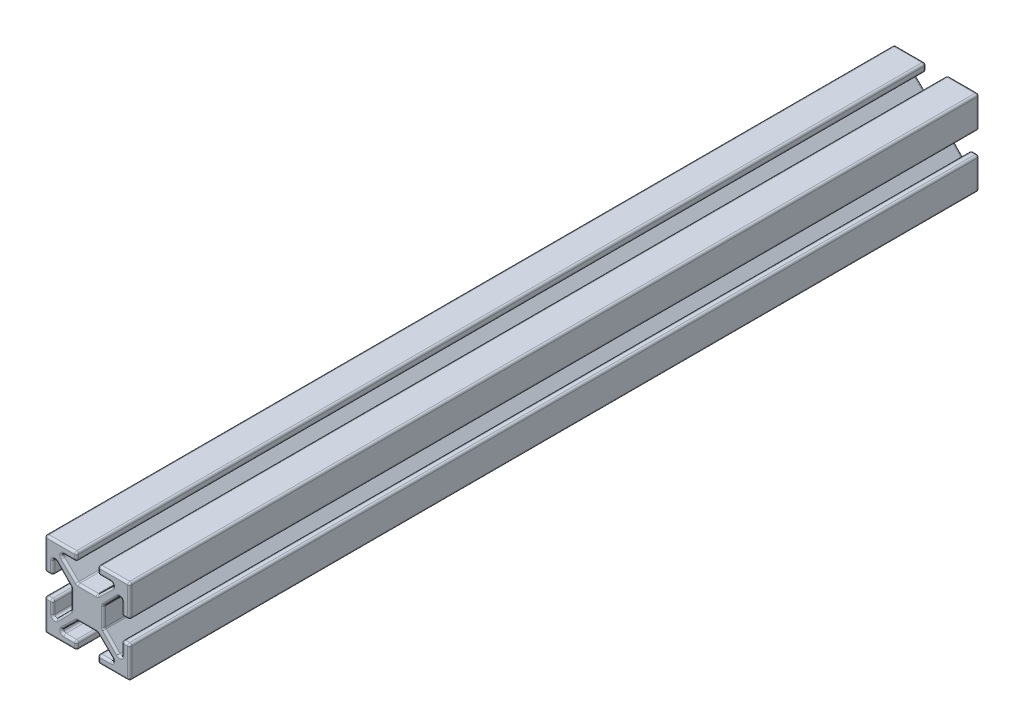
from build123d import *

# Parameters (mm, degrees)
BOSS_EXTRUDE1_DEPTH = 400
FILLET3_R           = 1


with BuildPart() as part:
    # Sketch1 → Boss-Extrude1 (new body)
    with BuildSketch(Plane.XY):
        Polygon((-5, 16.212568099), (-5, 20), (-20, 20), (-20, 5), (-16.212568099, 5), (-16.212568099, 13.432263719), (-7.689389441, 4.631155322), (-7.689389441, 0), (-7.689389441, -4.631155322), (-16.212568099, -13.432263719), (-16.212568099, -5), (-20, -5), (-20, -20), (-5, -20), (-5, -16.212568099), (-13.432263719, -16.212568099), (-4.631155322, -7.689389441), (0, -7.689389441), (4.631155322, -7.689389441), (13.432263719, -16.212568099), (5, -16.212568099), (5, -20), (20, -20), (20, -5), (16.212568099, -5), (16.212568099, -13.432263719), (7.689389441, -4.631155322), (7.689389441, 0), (7.689389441, 4.631155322), (16.212568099, 13.432263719), (16.212568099, 5), (20, 5), (20, 20), (5, 20), (5, 16.212568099), (13.432263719, 16.212568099), (4.631155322, 7.689389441), (0, 7.689389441), (-4.631155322, 7.689389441), (-13.432263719, 16.212568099), align=None)
    extrude(amount=BOSS_EXTRUDE1_DEPTH)

    # Fillet3
    fillet3_edges = [part.edges().sort_by_distance(p)[0] for p in [
        (0, 7.689389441, 400),
        (-9.03170952, 11.95097877, 400),
        (0, -7.689389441, 400),
        (-9.216131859, 16.212568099, 400),
        (-5, 18.10628405, 400),
        (-12.5, 20, 400),
        (-20, 12.5, 400),
        (-18.10628405, 5, 400),
        (-16.212568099, 9.216131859, 400),
        (-11.95097877, 9.03170952, 400),
        (-7.689389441, 0, 400),
        (-11.95097877, -9.03170952, 400),
        (-16.212568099, -9.216131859, 400),
        (-18.10628405, -5, 400),
        (-20, -12.5, 400),
        (-12.5, -20, 400),
        (9.031709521, -11.95097877, 400),
        (-5, -18.10628405, 400),
        (-9.216131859, -16.212568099, 400),
        (9.216131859, -16.212568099, 400),
        (5, -18.10628405, 400),
        (12.5, -20, 400),
        (20, -12.5, 400),
        (-9.216131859, -16.212568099, 0),
        (-5, -18.10628405, 0),
        (-12.5, -20, 0),
        (-20, -12.5, 0),
        (-18.10628405, -5, 0),
        (-16.212568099, -9.216131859, 0),
        (-11.95097877, -9.03170952, 0),
        (-7.689389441, 0, 0),
        (-11.95097877, 9.03170952, 0),
        (18.10628405, -5, 400),
        (-16.212568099, 9.216131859, 0),
        (-18.10628405, 5, 0),
        (-20, 12.5, 0),
        (-12.5, 20, 0),
        (-5, 18.10628405, 0),
        (-9.216131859, 16.212568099, 0),
        (-9.03170952, 11.95097877, 0),
        (0, 7.689389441, 0),
        (9.03170952, 11.95097877, 0),
        (9.216131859, 16.212568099, 0),
        (16.212568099, -9.216131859, 400),
        (5, 18.10628405, 0),
        (12.5, 20, 0),
        (20, 12.5, 0),
        (18.10628405, 5, 0),
        (16.212568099, 9.216131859, 0),
        (11.95097877, 9.03170952, 0),
        (7.689389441, 0, 0),
        (11.95097877, -9.03170952, 0),
        (16.212568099, -9.216131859, 0),
        (18.10628405, -5, 0),
        (11.95097877, -9.03170952, 400),
        (20, -12.5, 0),
        (12.5, -20, 0),
        (5, -18.10628405, 0),
        (9.216131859, -16.212568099, 0),
        (9.031709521, -11.95097877, 0),
        (0, -7.689389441, 0),
        (-9.03170952, -11.95097877, 0),
        (7.689389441, 0, 400),
        (-9.03170952, -11.95097877, 400),
        (11.95097877, 9.03170952, 400),
        (-13.432263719, -16.212568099, 200),
        (-5, -16.212568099, 200),
        (-5, -20, 200),
        (-20, -20, 200),
        (-20, -5, 200),
        (-16.212568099, -5, 200),
        (-16.212568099, -13.432263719, 200),
        (-7.689389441, -4.631155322, 200),
        (-7.689389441, 4.631155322, 200),
        (-16.212568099, 13.432263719, 200),
        (-16.212568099, 5, 200),
        (-20, 5, 200),
        (-20, 20, 200),
        (-5, 20, 200),
        (-5, 16.212568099, 200),
        (-13.432263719, 16.212568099, 200),
        (-4.631155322, 7.689389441, 200),
        (16.212568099, 9.216131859, 400),
        (4.631155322, 7.689389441, 200),
        (13.432263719, 16.212568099, 200),
        (5, 16.212568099, 200),
        (5, 20, 200),
        (20, 20, 200),
        (20, 5, 200),
        (16.212568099, 5, 200),
        (16.212568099, 13.432263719, 200),
        (7.689389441, 4.631155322, 200),
        (7.689389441, -4.631155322, 200),
        (16.212568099, -13.432263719, 200),
        (16.212568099, -5, 200),
        (20, -5, 200),
        (20, -20, 200),
        (5, -20, 200),
        (5, -16.212568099, 200),
        (13.432263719, -16.212568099, 200),
        (4.631155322, -7.689389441, 200),
        (-4.631155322, -7.689389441, 200),
        (18.10628405, 5, 400),
        (20, 12.5, 400),
        (12.5, 20, 400),
        (5, 18.10628405, 400),
        (9.216131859, 16.212568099, 400),
        (9.03170952, 11.95097877, 400),
    ]]
    fillet(fillet3_edges, radius=FILLET3_R)


solid = part.part
